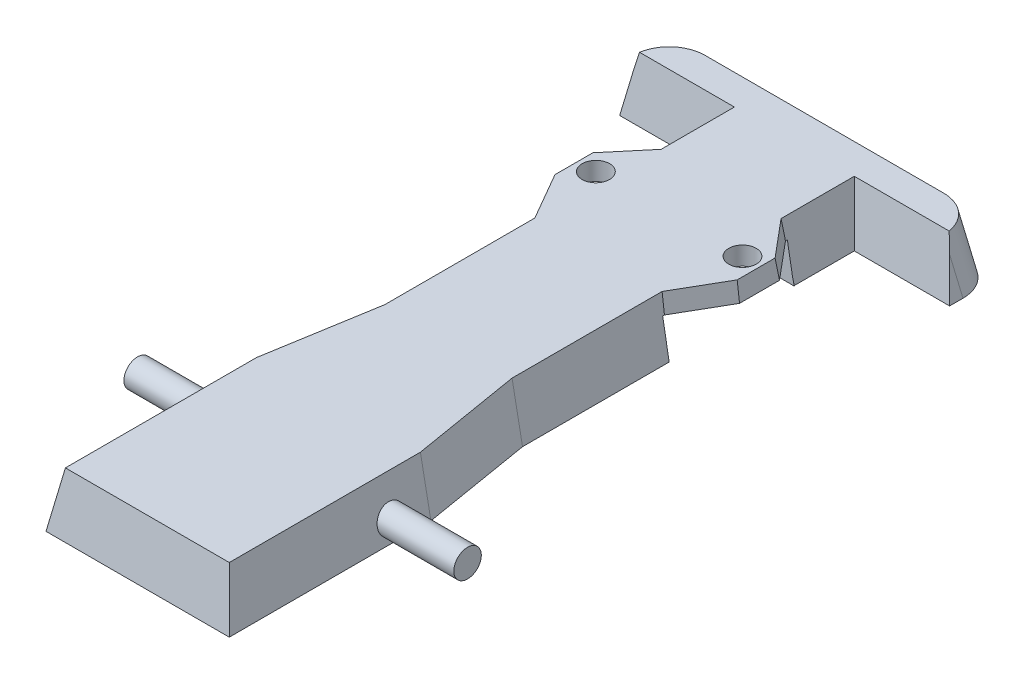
ISO-10303-21;
HEADER;
FILE_DESCRIPTION(('STEP AP214'),'2;1');
FILE_NAME('part.step','',(''),(''),'','','');
FILE_SCHEMA(('AUTOMOTIVE_DESIGN { 1 0 10303 214 1 1 1 1 }'));
ENDSEC;
DATA;
#1=APPLICATION_CONTEXT('core data for automotive mechanical design processes');
#2=APPLICATION_PROTOCOL_DEFINITION('international standard','automotive_design',2000,#1);
#3=PRODUCT_CONTEXT('',#1,'mechanical');
#4=PRODUCT('Part','Part','',(#3));
#5=PRODUCT_RELATED_PRODUCT_CATEGORY('part','',(#4));
#6=PRODUCT_DEFINITION_FORMATION('','',#4);
#7=PRODUCT_DEFINITION_CONTEXT('part definition',#1,'design');
#8=PRODUCT_DEFINITION('design','',#6,#7);
#9=PRODUCT_DEFINITION_SHAPE('','',#8);
#10=(LENGTH_UNIT() NAMED_UNIT(*) SI_UNIT(.MILLI.,.METRE.));
#11=(NAMED_UNIT(*) PLANE_ANGLE_UNIT() SI_UNIT($,.RADIAN.));
#12=(NAMED_UNIT(*) SI_UNIT($,.STERADIAN.) SOLID_ANGLE_UNIT());
#13=UNCERTAINTY_MEASURE_WITH_UNIT(LENGTH_MEASURE(1.E-05),#10,'distance_accuracy_value','');
#14=(GEOMETRIC_REPRESENTATION_CONTEXT(3) GLOBAL_UNCERTAINTY_ASSIGNED_CONTEXT((#13)) GLOBAL_UNIT_ASSIGNED_CONTEXT((#10,
#11,#12)) REPRESENTATION_CONTEXT('',''));
#15=CARTESIAN_POINT('',(0.,0.,0.));
#16=DIRECTION('',(0.,0.,1.));
#17=DIRECTION('',(1.,0.,0.));
#18=AXIS2_PLACEMENT_3D('',#15,#16,#17);
#19=CARTESIAN_POINT('',(282.092260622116,0.,-236.70351184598));
#20=DIRECTION('',(0.754406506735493,0.173648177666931,-0.633022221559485));
#21=DIRECTION('',(-0.642787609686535,0.,-0.766044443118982));
#22=AXIS2_PLACEMENT_3D('',#19,#20,#21);
#23=PLANE('',#22);
#24=DIRECTION('',(-0.642787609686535,0.,-0.766044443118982));
#25=VECTOR('',#24,1.);
#26=CARTESIAN_POINT('',(275.230485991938,50.8,-230.945799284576));
#27=LINE('',#26,#25);
#28=CARTESIAN_POINT('',(87.56258938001,50.8,-454.599689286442));
#29=VERTEX_POINT('',#28);
#30=CARTESIAN_POINT('',(130.74258938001,50.8,-403.139769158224));
#31=VERTEX_POINT('',#30);
#32=EDGE_CURVE('E325',#29,#31,#27,.F.);
#33=ORIENTED_EDGE('',*,*,#32,.F.);
#34=DIRECTION('',(0.173302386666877,-0.982846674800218,-0.0630769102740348));
#35=VECTOR('',#34,1.);
#36=CARTESIAN_POINT('',(99.6758802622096,-17.897886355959,-459.008566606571));
#37=LINE('',#36,#35);
#38=CARTESIAN_POINT('',(83.083884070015,76.2,-452.969573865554));
#39=VERTEX_POINT('',#38);
#40=EDGE_CURVE('E279',#39,#29,#37,.T.);
#41=ORIENTED_EDGE('',*,*,#40,.F.);
#42=DIRECTION('',(0.642787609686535,0.,0.766044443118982));
#43=VECTOR('',#42,1.);
#44=CARTESIAN_POINT('',(271.799598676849,76.2,-228.066943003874));
#45=LINE('',#44,#43);
#46=CARTESIAN_POINT('',(126.263884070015,76.2,-401.509653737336));
#47=VERTEX_POINT('',#46);
#48=EDGE_CURVE('E383',#47,#39,#45,.F.);
#49=ORIENTED_EDGE('',*,*,#48,.F.);
#50=DIRECTION('',(0.173302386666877,-0.982846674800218,-0.0630769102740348));
#51=VECTOR('',#50,1.);
#52=CARTESIAN_POINT('',(142.12155224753,-13.7333052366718,-407.281372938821));
#53=LINE('',#52,#51);
#54=EDGE_CURVE('E283',#47,#31,#53,.T.);
#55=ORIENTED_EDGE('',*,*,#54,.T.);
#56=EDGE_LOOP('',(#33,#41,#49,#55));
#57=FACE_BOUND('',#56,.T.);
#58=ADVANCED_FACE('F38',(#57),#23,.T.);
#59=CARTESIAN_POINT('',(-282.092260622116,0.,-236.70351184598));
#60=DIRECTION('',(-0.754406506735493,0.173648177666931,-0.633022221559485));
#61=DIRECTION('',(-0.642787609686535,0.,0.766044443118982));
#62=AXIS2_PLACEMENT_3D('',#59,#60,#61);
#63=PLANE('',#62);
#64=DIRECTION('',(-0.224312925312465,-0.974517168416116,0.));
#65=VECTOR('',#64,1.);
#66=CARTESIAN_POINT('',(-106.383184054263,-40.4444562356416,-457.2));
#67=LINE('',#66,#65);
#68=CARTESIAN_POINT('',(-97.0737387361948,0.,-457.2));
#69=VERTEX_POINT('',#68);
#70=CARTESIAN_POINT('',(-94.7068843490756,10.2826898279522,-457.2));
#71=VERTEX_POINT('',#70);
#72=EDGE_CURVE('E254',#69,#71,#67,.F.);
#73=ORIENTED_EDGE('',*,*,#72,.T.);
#74=DIRECTION('',(-0.173302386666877,-0.982846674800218,-0.0630769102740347));
#75=VECTOR('',#74,1.);
#76=CARTESIAN_POINT('',(-91.5149596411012,28.3849943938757,-456.038234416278));
#77=LINE('',#76,#75);
#78=CARTESIAN_POINT('',(-96.52,0.,-457.859920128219));
#79=VERTEX_POINT('',#78);
#80=EDGE_CURVE('E264',#71,#79,#77,.T.);
#81=ORIENTED_EDGE('',*,*,#80,.T.);
#82=DIRECTION('',(0.642787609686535,0.,-0.766044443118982));
#83=VECTOR('',#82,1.);
#84=CARTESIAN_POINT('',(-282.092260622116,0.,-236.70351184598));
#85=LINE('',#84,#83);
#86=EDGE_CURVE('E329',#79,#69,#85,.F.);
#87=ORIENTED_EDGE('',*,*,#86,.T.);
#88=EDGE_LOOP('',(#73,#81,#87));
#89=FACE_BOUND('',#88,.T.);
#90=ADVANCED_FACE('F547',(#89),#63,.T.);
#91=CARTESIAN_POINT('',(0.,0.,0.));
#92=DIRECTION('',(0.,1.,0.));
#93=DIRECTION('',(0.,0.,1.));
#94=AXIS2_PLACEMENT_3D('',#91,#92,#93);
#95=PLANE('',#94);
#96=DIRECTION('',(0.,0.,-1.));
#97=VECTOR('',#96,1.);
#98=CARTESIAN_POINT('',(-101.6,0.,0.));
#99=LINE('',#98,#97);
#100=CARTESIAN_POINT('',(-101.6,0.,-279.4));
#101=VERTEX_POINT('',#100);
#102=CARTESIAN_POINT('',(-101.6,0.,-76.2));
#103=VERTEX_POINT('',#102);
#104=EDGE_CURVE('E312',#101,#103,#99,.F.);
#105=ORIENTED_EDGE('',*,*,#104,.F.);
#106=DIRECTION('',(-1.,0.,0.));
#107=VECTOR('',#106,1.);
#108=CARTESIAN_POINT('',(-139.7,0.,-279.4));
#109=LINE('',#108,#107);
#110=CARTESIAN_POINT('',(101.6,0.,-279.4));
#111=VERTEX_POINT('',#110);
#112=EDGE_CURVE('E321',#111,#101,#109,.T.);
#113=ORIENTED_EDGE('',*,*,#112,.F.);
#114=DIRECTION('',(0.,0.,1.));
#115=VECTOR('',#114,1.);
#116=CARTESIAN_POINT('',(101.6,0.,0.));
#117=LINE('',#116,#115);
#118=CARTESIAN_POINT('',(101.6,0.,-76.2000000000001));
#119=VERTEX_POINT('',#118);
#120=EDGE_CURVE('E353',#119,#111,#117,.F.);
#121=ORIENTED_EDGE('',*,*,#120,.F.);
#122=DIRECTION('',(0.164398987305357,0.,0.986393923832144));
#123=VECTOR('',#122,1.);
#124=CARTESIAN_POINT('',(111.210810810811,0.,-18.5351351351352));
#125=LINE('',#124,#123);
#126=CARTESIAN_POINT('',(127.,0.,76.2));
#127=VERTEX_POINT('',#126);
#128=EDGE_CURVE('E363',#127,#119,#125,.F.);
#129=ORIENTED_EDGE('',*,*,#128,.F.);
#130=DIRECTION('',(0.,0.,1.));
#131=VECTOR('',#130,1.);
#132=CARTESIAN_POINT('',(127.,0.,0.));
#133=LINE('',#132,#131);
#134=CARTESIAN_POINT('',(127.,0.,355.6));
#135=VERTEX_POINT('',#134);
#136=EDGE_CURVE('E365',#135,#127,#133,.F.);
#137=ORIENTED_EDGE('',*,*,#136,.F.);
#138=DIRECTION('',(-1.,0.,0.));
#139=VECTOR('',#138,1.);
#140=CARTESIAN_POINT('',(0.,0.,355.6));
#141=LINE('',#140,#139);
#142=CARTESIAN_POINT('',(-127.,0.,355.6));
#143=VERTEX_POINT('',#142);
#144=EDGE_CURVE('E309',#143,#135,#141,.F.);
#145=ORIENTED_EDGE('',*,*,#144,.F.);
#146=DIRECTION('',(0.,0.,-1.));
#147=VECTOR('',#146,1.);
#148=CARTESIAN_POINT('',(-127.,0.,0.));
#149=LINE('',#148,#147);
#150=CARTESIAN_POINT('',(-127.,0.,76.2));
#151=VERTEX_POINT('',#150);
#152=EDGE_CURVE('E307',#151,#143,#149,.F.);
#153=ORIENTED_EDGE('',*,*,#152,.F.);
#154=DIRECTION('',(0.164398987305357,0.,-0.986393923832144));
#155=VECTOR('',#154,1.);
#156=CARTESIAN_POINT('',(-111.210810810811,0.,-18.5351351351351));
#157=LINE('',#156,#155);
#158=EDGE_CURVE('E310',#103,#151,#157,.F.);
#159=ORIENTED_EDGE('',*,*,#158,.F.);
#160=EDGE_LOOP('',(#105,#113,#121,#129,#137,#145,#153,#159));
#161=FACE_BOUND('',#160,.T.);
#162=ADVANCED_FACE('F511',(#161),#95,.F.);
#163=CARTESIAN_POINT('',(-139.7,0.,0.));
#164=DIRECTION('',(-0.984807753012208,0.173648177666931,0.));
#165=DIRECTION('',(-0.173648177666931,-0.984807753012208,0.));
#166=AXIS2_PLACEMENT_3D('',#163,#164,#165);
#167=PLANE('',#166);
#168=DIRECTION('',(0.,0.,1.));
#169=VECTOR('',#168,1.);
#170=CARTESIAN_POINT('',(-130.74258938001,50.8,0.));
#171=LINE('',#170,#169);
#172=CARTESIAN_POINT('',(-130.74258938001,50.8,-347.791266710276));
#173=VERTEX_POINT('',#172);
#174=CARTESIAN_POINT('',(-130.74258938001,50.8,-403.139769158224));
#175=VERTEX_POINT('',#174);
#176=EDGE_CURVE('E318',#173,#175,#171,.F.);
#177=ORIENTED_EDGE('',*,*,#176,.F.);
#178=DIRECTION('',(-0.173460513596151,-0.983743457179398,0.0464786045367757));
#179=VECTOR('',#178,1.);
#180=CARTESIAN_POINT('',(-136.725309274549,16.870309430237,-346.188201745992));
#181=LINE('',#180,#179);
#182=CARTESIAN_POINT('',(-126.263884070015,76.2,-348.991332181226));
#183=VERTEX_POINT('',#182);
#184=EDGE_CURVE('E245',#183,#173,#181,.T.);
#185=ORIENTED_EDGE('',*,*,#184,.F.);
#186=DIRECTION('',(0.,0.,-1.));
#187=VECTOR('',#186,1.);
#188=CARTESIAN_POINT('',(-126.263884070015,76.2,0.));
#189=LINE('',#188,#187);
#190=CARTESIAN_POINT('',(-126.263884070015,76.2,-401.509653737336));
#191=VERTEX_POINT('',#190);
#192=EDGE_CURVE('E332',#191,#183,#189,.F.);
#193=ORIENTED_EDGE('',*,*,#192,.F.);
#194=DIRECTION('',(-0.173302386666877,-0.982846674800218,-0.0630769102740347));
#195=VECTOR('',#194,1.);
#196=CARTESIAN_POINT('',(-135.257487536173,25.1947401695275,-404.78305769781));
#197=LINE('',#196,#195);
#198=EDGE_CURVE('E261',#191,#175,#197,.T.);
#199=ORIENTED_EDGE('',*,*,#198,.T.);
#200=EDGE_LOOP('',(#177,#185,#193,#199));
#201=FACE_BOUND('',#200,.T.);
#202=ADVANCED_FACE('F583',(#201),#167,.T.);
#203=CARTESIAN_POINT('',(44.7837489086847,0.,-25.8559094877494));
#204=DIRECTION('',(-0.852868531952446,0.173648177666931,0.492403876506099));
#205=DIRECTION('',(0.499999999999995,0.,0.866025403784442));
#206=AXIS2_PLACEMENT_3D('',#203,#204,#205);
#207=PLANE('',#206);
#208=DIRECTION('',(0.499999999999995,0.,0.866025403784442));
#209=VECTOR('',#208,1.);
#210=CARTESIAN_POINT('',(52.5410940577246,50.8,-30.3346147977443));
#211=LINE('',#210,#209);
#212=CARTESIAN_POINT('',(-92.6425893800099,50.8,-281.8001309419));
#213=VERTEX_POINT('',#212);
#214=EDGE_CURVE('E226',#213,#173,#211,.F.);
#215=ORIENTED_EDGE('',*,*,#214,.F.);
#216=DIRECTION('',(-0.173460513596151,-0.983743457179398,0.0464786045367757));
#217=VECTOR('',#216,1.);
#218=CARTESIAN_POINT('',(-99.2396491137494,13.3862150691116,-280.032454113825));
#219=LINE('',#218,#217);
#220=CARTESIAN_POINT('',(-88.1638840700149,76.2,-283.000196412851));
#221=VERTEX_POINT('',#220);
#222=EDGE_CURVE('E242',#221,#213,#219,.T.);
#223=ORIENTED_EDGE('',*,*,#222,.F.);
#224=DIRECTION('',(-0.499999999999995,0.,-0.866025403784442));
#225=VECTOR('',#224,1.);
#226=CARTESIAN_POINT('',(56.4197666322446,76.2,-32.5739674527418));
#227=LINE('',#226,#225);
#228=EDGE_CURVE('E400',#183,#221,#227,.F.);
#229=ORIENTED_EDGE('',*,*,#228,.F.);
#230=ORIENTED_EDGE('',*,*,#184,.T.);
#231=EDGE_LOOP('',(#215,#223,#229,#230));
#232=FACE_BOUND('',#231,.T.);
#233=ADVANCED_FACE('F241',(#232),#207,.T.);
#234=CARTESIAN_POINT('',(-44.783748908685,0.,-25.8559094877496));
#235=DIRECTION('',(0.852868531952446,0.173648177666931,0.4924038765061));
#236=DIRECTION('',(0.499999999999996,0.,-0.866025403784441));
#237=AXIS2_PLACEMENT_3D('',#234,#235,#236);
#238=PLANE('',#237);
#239=DIRECTION('',(0.499999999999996,0.,-0.866025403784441));
#240=VECTOR('',#239,1.);
#241=CARTESIAN_POINT('',(-52.541094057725,50.8,-30.3346147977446));
#242=LINE('',#241,#240);
#243=CARTESIAN_POINT('',(130.74258938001,50.8,-347.791266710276));
#244=VERTEX_POINT('',#243);
#245=CARTESIAN_POINT('',(92.6425893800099,50.8,-281.8001309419));
#246=VERTEX_POINT('',#245);
#247=EDGE_CURVE('E247',#244,#246,#242,.F.);
#248=ORIENTED_EDGE('',*,*,#247,.F.);
#249=DIRECTION('',(0.173460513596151,-0.983743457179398,0.0464786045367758));
#250=VECTOR('',#249,1.);
#251=CARTESIAN_POINT('',(142.484613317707,-15.7923268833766,-344.645000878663));
#252=LINE('',#251,#250);
#253=CARTESIAN_POINT('',(126.263884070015,76.2,-348.991332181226));
#254=VERTEX_POINT('',#253);
#255=EDGE_CURVE('E286',#254,#244,#252,.T.);
#256=ORIENTED_EDGE('',*,*,#255,.F.);
#257=DIRECTION('',(-0.499999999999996,0.,0.866025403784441));
#258=VECTOR('',#257,1.);
#259=CARTESIAN_POINT('',(-56.4197666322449,76.2,-32.5739674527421));
#260=LINE('',#259,#258);
#261=CARTESIAN_POINT('',(88.1638840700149,76.2,-283.000196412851));
#262=VERTEX_POINT('',#261);
#263=EDGE_CURVE('E379',#262,#254,#260,.F.);
#264=ORIENTED_EDGE('',*,*,#263,.F.);
#265=DIRECTION('',(0.173460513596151,-0.983743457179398,0.0464786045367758));
#266=VECTOR('',#265,1.);
#267=CARTESIAN_POINT('',(103.852579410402,-12.7750126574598,-278.796423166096));
#268=LINE('',#267,#266);
#269=EDGE_CURVE('E290',#262,#246,#268,.T.);
#270=ORIENTED_EDGE('',*,*,#269,.T.);
#271=EDGE_LOOP('',(#248,#256,#264,#270));
#272=FACE_BOUND('',#271,.T.);
#273=ADVANCED_FACE('F589',(#272),#238,.T.);
#274=CARTESIAN_POINT('',(139.7,0.,-1.27111165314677E-13));
#275=DIRECTION('',(0.984807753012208,0.173648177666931,0.));
#276=DIRECTION('',(-0.173648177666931,0.984807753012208,0.));
#277=AXIS2_PLACEMENT_3D('',#274,#275,#276);
#278=PLANE('',#277);
#279=DIRECTION('',(0.,0.,-1.));
#280=VECTOR('',#279,1.);
#281=CARTESIAN_POINT('',(130.74258938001,50.8,-1.18960936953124E-13));
#282=LINE('',#281,#280);
#283=EDGE_CURVE('E356',#31,#244,#282,.F.);
#284=ORIENTED_EDGE('',*,*,#283,.F.);
#285=ORIENTED_EDGE('',*,*,#54,.F.);
#286=DIRECTION('',(0.,0.,1.));
#287=VECTOR('',#286,1.);
#288=CARTESIAN_POINT('',(126.263884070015,76.2,-1.14885822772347E-13));
#289=LINE('',#288,#287);
#290=EDGE_CURVE('E381',#254,#47,#289,.F.);
#291=ORIENTED_EDGE('',*,*,#290,.F.);
#292=ORIENTED_EDGE('',*,*,#255,.T.);
#293=EDGE_LOOP('',(#284,#285,#291,#292));
#294=FACE_BOUND('',#293,.T.);
#295=ADVANCED_FACE('F606',(#294),#278,.T.);
#296=CARTESIAN_POINT('',(-101.6,76.2,-381.));
#297=DIRECTION('',(0.,-1.,0.));
#298=DIRECTION('',(0.,0.,-1.));
#299=AXIS2_PLACEMENT_3D('',#296,#297,#298);
#300=CYLINDRICAL_SURFACE('',#299,19.05);
#301=CARTESIAN_POINT('',(-101.6,76.2,-381.));
#302=DIRECTION('',(0.,1.,0.));
#303=DIRECTION('',(0.,0.,1.));
#304=AXIS2_PLACEMENT_3D('',#301,#302,#303);
#305=CIRCLE('',#304,19.05);
#306=CARTESIAN_POINT('',(-101.6,76.2,-400.05));
#307=VERTEX_POINT('',#306);
#308=EDGE_CURVE('E314',#307,#307,#305,.T.);
#309=CARTESIAN_POINT('',(-101.6,50.8,-381.));
#310=DIRECTION('',(0.,-1.,0.));
#311=DIRECTION('',(0.,0.,-1.));
#312=AXIS2_PLACEMENT_3D('',#309,#310,#311);
#313=CIRCLE('',#312,19.05);
#314=CARTESIAN_POINT('',(-101.6,50.8,-400.05));
#315=VERTEX_POINT('',#314);
#316=EDGE_CURVE('E326',#315,#315,#313,.T.);
#317=CARTESIAN_POINT('',(-101.6,76.2,-400.05));
#318=CARTESIAN_POINT('',(-101.6,75.9354166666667,-400.05));
#319=CARTESIAN_POINT('',(-101.6,75.6708333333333,-400.05));
#320=CARTESIAN_POINT('',(-101.6,75.1416666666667,-400.05));
#321=CARTESIAN_POINT('',(-101.6,74.8770833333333,-400.05));
#322=CARTESIAN_POINT('',(-101.6,74.3479166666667,-400.05));
#323=CARTESIAN_POINT('',(-101.6,74.0833333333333,-400.05));
#324=CARTESIAN_POINT('',(-101.6,73.5541666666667,-400.05));
#325=CARTESIAN_POINT('',(-101.6,73.2895833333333,-400.05));
#326=CARTESIAN_POINT('',(-101.6,72.7604166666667,-400.05));
#327=CARTESIAN_POINT('',(-101.6,72.4958333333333,-400.05));
#328=CARTESIAN_POINT('',(-101.6,71.9666666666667,-400.05));
#329=CARTESIAN_POINT('',(-101.6,71.7020833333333,-400.05));
#330=CARTESIAN_POINT('',(-101.6,71.1729166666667,-400.05));
#331=CARTESIAN_POINT('',(-101.6,70.9083333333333,-400.05));
#332=CARTESIAN_POINT('',(-101.6,70.3791666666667,-400.05));
#333=CARTESIAN_POINT('',(-101.6,70.1145833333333,-400.05));
#334=CARTESIAN_POINT('',(-101.6,69.5854166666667,-400.05));
#335=CARTESIAN_POINT('',(-101.6,69.3208333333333,-400.05));
#336=CARTESIAN_POINT('',(-101.6,68.7916666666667,-400.05));
#337=CARTESIAN_POINT('',(-101.6,68.5270833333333,-400.05));
#338=CARTESIAN_POINT('',(-101.6,67.9979166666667,-400.05));
#339=CARTESIAN_POINT('',(-101.6,67.7333333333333,-400.05));
#340=CARTESIAN_POINT('',(-101.6,67.2041666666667,-400.05));
#341=CARTESIAN_POINT('',(-101.6,66.9395833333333,-400.05));
#342=CARTESIAN_POINT('',(-101.6,66.4104166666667,-400.05));
#343=CARTESIAN_POINT('',(-101.6,66.1458333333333,-400.05));
#344=CARTESIAN_POINT('',(-101.6,65.6166666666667,-400.05));
#345=CARTESIAN_POINT('',(-101.6,65.3520833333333,-400.05));
#346=CARTESIAN_POINT('',(-101.6,64.8229166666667,-400.05));
#347=CARTESIAN_POINT('',(-101.6,64.5583333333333,-400.05));
#348=CARTESIAN_POINT('',(-101.6,64.0291666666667,-400.05));
#349=CARTESIAN_POINT('',(-101.6,63.7645833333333,-400.05));
#350=CARTESIAN_POINT('',(-101.6,63.2354166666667,-400.05));
#351=CARTESIAN_POINT('',(-101.6,62.9708333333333,-400.05));
#352=CARTESIAN_POINT('',(-101.6,62.4416666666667,-400.05));
#353=CARTESIAN_POINT('',(-101.6,62.1770833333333,-400.05));
#354=CARTESIAN_POINT('',(-101.6,61.6479166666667,-400.05));
#355=CARTESIAN_POINT('',(-101.6,61.3833333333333,-400.05));
#356=CARTESIAN_POINT('',(-101.6,60.8541666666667,-400.05));
#357=CARTESIAN_POINT('',(-101.6,60.5895833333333,-400.05));
#358=CARTESIAN_POINT('',(-101.6,60.0604166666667,-400.05));
#359=CARTESIAN_POINT('',(-101.6,59.7958333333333,-400.05));
#360=CARTESIAN_POINT('',(-101.6,59.2666666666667,-400.05));
#361=CARTESIAN_POINT('',(-101.6,59.0020833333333,-400.05));
#362=CARTESIAN_POINT('',(-101.6,58.4729166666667,-400.05));
#363=CARTESIAN_POINT('',(-101.6,58.2083333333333,-400.05));
#364=CARTESIAN_POINT('',(-101.6,57.6791666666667,-400.05));
#365=CARTESIAN_POINT('',(-101.6,57.4145833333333,-400.05));
#366=CARTESIAN_POINT('',(-101.6,56.8854166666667,-400.05));
#367=CARTESIAN_POINT('',(-101.6,56.6208333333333,-400.05));
#368=CARTESIAN_POINT('',(-101.6,56.0916666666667,-400.05));
#369=CARTESIAN_POINT('',(-101.6,55.8270833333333,-400.05));
#370=CARTESIAN_POINT('',(-101.6,55.2979166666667,-400.05));
#371=CARTESIAN_POINT('',(-101.6,55.0333333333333,-400.05));
#372=CARTESIAN_POINT('',(-101.6,54.5041666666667,-400.05));
#373=CARTESIAN_POINT('',(-101.6,54.2395833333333,-400.05));
#374=CARTESIAN_POINT('',(-101.6,53.7104166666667,-400.05));
#375=CARTESIAN_POINT('',(-101.6,53.4458333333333,-400.05));
#376=CARTESIAN_POINT('',(-101.6,52.9166666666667,-400.05));
#377=CARTESIAN_POINT('',(-101.6,52.6520833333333,-400.05));
#378=CARTESIAN_POINT('',(-101.6,52.1229166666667,-400.05));
#379=CARTESIAN_POINT('',(-101.6,51.8583333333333,-400.05));
#380=CARTESIAN_POINT('',(-101.6,51.3291666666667,-400.05));
#381=CARTESIAN_POINT('',(-101.6,51.0645833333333,-400.05));
#382=CARTESIAN_POINT('',(-101.6,50.8,-400.05));
#383=B_SPLINE_CURVE_WITH_KNOTS('',3,(#317,#318,#319,#320,#321,#322,#323,#324,#325,#326,#327,
#328,#329,#330,#331,#332,#333,#334,#335,#336,#337,#338,#339,#340,#341,#342,#343,#344,#345,#346,
#347,#348,#349,#350,#351,#352,#353,#354,#355,#356,#357,#358,#359,#360,#361,#362,#363,#364,#365,
#366,#367,#368,#369,#370,#371,#372,#373,#374,#375,#376,#377,#378,#379,#380,#381,#382),
.UNSPECIFIED.,.F.,.F.,(4,2,2,2,2,2,2,2,2,2,2,2,2,2,2,2,2,2,2,2,2,2,2,2,2,2,2,2,2,2,2,2,4),(0.,
0.793749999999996,1.58749999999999,2.38124999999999,3.175,3.96874999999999,4.76249999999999,
5.55624999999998,6.34999999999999,7.14374999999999,7.93749999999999,8.73125,9.52499999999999,
10.31875,11.1125,11.90625,12.7,13.49375,14.2875,15.08125,15.875,16.66875,17.4625,18.25625,19.05,
19.84375,20.6375,21.43125,22.225,23.01875,23.8125,24.60625,25.4),.UNSPECIFIED.);
#384=EDGE_CURVE('BSEAM603',#307,#315,#383,.T.);
#385=ORIENTED_EDGE('',*,*,#308,.T.);
#386=ORIENTED_EDGE('',*,*,#316,.T.);
#387=ORIENTED_EDGE('',*,*,#384,.T.);
#388=ORIENTED_EDGE('',*,*,#384,.F.);
#389=EDGE_LOOP('',(#385,#387,#386,#388));
#390=FACE_BOUND('',#389,.T.);
#391=ADVANCED_FACE('F603',(#390),#300,.F.);
#392=CARTESIAN_POINT('',(101.6,76.2,-381.));
#393=DIRECTION('',(0.,-1.,0.));
#394=DIRECTION('',(0.,0.,-1.));
#395=AXIS2_PLACEMENT_3D('',#392,#393,#394);
#396=CYLINDRICAL_SURFACE('',#395,19.05);
#397=CARTESIAN_POINT('',(101.6,76.2,-381.));
#398=DIRECTION('',(0.,1.,0.));
#399=DIRECTION('',(0.,0.,1.));
#400=AXIS2_PLACEMENT_3D('',#397,#398,#399);
#401=CIRCLE('',#400,19.05);
#402=CARTESIAN_POINT('',(101.6,76.2,-400.05));
#403=VERTEX_POINT('',#402);
#404=EDGE_CURVE('E316',#403,#403,#401,.T.);
#405=CARTESIAN_POINT('',(101.6,50.8,-381.));
#406=DIRECTION('',(0.,-1.,0.));
#407=DIRECTION('',(0.,0.,-1.));
#408=AXIS2_PLACEMENT_3D('',#405,#406,#407);
#409=CIRCLE('',#408,19.05);
#410=CARTESIAN_POINT('',(101.6,50.8,-400.05));
#411=VERTEX_POINT('',#410);
#412=EDGE_CURVE('E490',#411,#411,#409,.T.);
#413=CARTESIAN_POINT('',(101.6,76.2,-400.05));
#414=CARTESIAN_POINT('',(101.6,75.9354166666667,-400.05));
#415=CARTESIAN_POINT('',(101.6,75.6708333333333,-400.05));
#416=CARTESIAN_POINT('',(101.6,75.1416666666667,-400.05));
#417=CARTESIAN_POINT('',(101.6,74.8770833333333,-400.05));
#418=CARTESIAN_POINT('',(101.6,74.3479166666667,-400.05));
#419=CARTESIAN_POINT('',(101.6,74.0833333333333,-400.05));
#420=CARTESIAN_POINT('',(101.6,73.5541666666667,-400.05));
#421=CARTESIAN_POINT('',(101.6,73.2895833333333,-400.05));
#422=CARTESIAN_POINT('',(101.6,72.7604166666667,-400.05));
#423=CARTESIAN_POINT('',(101.6,72.4958333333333,-400.05));
#424=CARTESIAN_POINT('',(101.6,71.9666666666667,-400.05));
#425=CARTESIAN_POINT('',(101.6,71.7020833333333,-400.05));
#426=CARTESIAN_POINT('',(101.6,71.1729166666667,-400.05));
#427=CARTESIAN_POINT('',(101.6,70.9083333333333,-400.05));
#428=CARTESIAN_POINT('',(101.6,70.3791666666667,-400.05));
#429=CARTESIAN_POINT('',(101.6,70.1145833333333,-400.05));
#430=CARTESIAN_POINT('',(101.6,69.5854166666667,-400.05));
#431=CARTESIAN_POINT('',(101.6,69.3208333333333,-400.05));
#432=CARTESIAN_POINT('',(101.6,68.7916666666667,-400.05));
#433=CARTESIAN_POINT('',(101.6,68.5270833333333,-400.05));
#434=CARTESIAN_POINT('',(101.6,67.9979166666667,-400.05));
#435=CARTESIAN_POINT('',(101.6,67.7333333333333,-400.05));
#436=CARTESIAN_POINT('',(101.6,67.2041666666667,-400.05));
#437=CARTESIAN_POINT('',(101.6,66.9395833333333,-400.05));
#438=CARTESIAN_POINT('',(101.6,66.4104166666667,-400.05));
#439=CARTESIAN_POINT('',(101.6,66.1458333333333,-400.05));
#440=CARTESIAN_POINT('',(101.6,65.6166666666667,-400.05));
#441=CARTESIAN_POINT('',(101.6,65.3520833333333,-400.05));
#442=CARTESIAN_POINT('',(101.6,64.8229166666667,-400.05));
#443=CARTESIAN_POINT('',(101.6,64.5583333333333,-400.05));
#444=CARTESIAN_POINT('',(101.6,64.0291666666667,-400.05));
#445=CARTESIAN_POINT('',(101.6,63.7645833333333,-400.05));
#446=CARTESIAN_POINT('',(101.6,63.2354166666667,-400.05));
#447=CARTESIAN_POINT('',(101.6,62.9708333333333,-400.05));
#448=CARTESIAN_POINT('',(101.6,62.4416666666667,-400.05));
#449=CARTESIAN_POINT('',(101.6,62.1770833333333,-400.05));
#450=CARTESIAN_POINT('',(101.6,61.6479166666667,-400.05));
#451=CARTESIAN_POINT('',(101.6,61.3833333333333,-400.05));
#452=CARTESIAN_POINT('',(101.6,60.8541666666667,-400.05));
#453=CARTESIAN_POINT('',(101.6,60.5895833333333,-400.05));
#454=CARTESIAN_POINT('',(101.6,60.0604166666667,-400.05));
#455=CARTESIAN_POINT('',(101.6,59.7958333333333,-400.05));
#456=CARTESIAN_POINT('',(101.6,59.2666666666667,-400.05));
#457=CARTESIAN_POINT('',(101.6,59.0020833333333,-400.05));
#458=CARTESIAN_POINT('',(101.6,58.4729166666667,-400.05));
#459=CARTESIAN_POINT('',(101.6,58.2083333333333,-400.05));
#460=CARTESIAN_POINT('',(101.6,57.6791666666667,-400.05));
#461=CARTESIAN_POINT('',(101.6,57.4145833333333,-400.05));
#462=CARTESIAN_POINT('',(101.6,56.8854166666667,-400.05));
#463=CARTESIAN_POINT('',(101.6,56.6208333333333,-400.05));
#464=CARTESIAN_POINT('',(101.6,56.0916666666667,-400.05));
#465=CARTESIAN_POINT('',(101.6,55.8270833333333,-400.05));
#466=CARTESIAN_POINT('',(101.6,55.2979166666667,-400.05));
#467=CARTESIAN_POINT('',(101.6,55.0333333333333,-400.05));
#468=CARTESIAN_POINT('',(101.6,54.5041666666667,-400.05));
#469=CARTESIAN_POINT('',(101.6,54.2395833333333,-400.05));
#470=CARTESIAN_POINT('',(101.6,53.7104166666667,-400.05));
#471=CARTESIAN_POINT('',(101.6,53.4458333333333,-400.05));
#472=CARTESIAN_POINT('',(101.6,52.9166666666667,-400.05));
#473=CARTESIAN_POINT('',(101.6,52.6520833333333,-400.05));
#474=CARTESIAN_POINT('',(101.6,52.1229166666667,-400.05));
#475=CARTESIAN_POINT('',(101.6,51.8583333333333,-400.05));
#476=CARTESIAN_POINT('',(101.6,51.3291666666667,-400.05));
#477=CARTESIAN_POINT('',(101.6,51.0645833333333,-400.05));
#478=CARTESIAN_POINT('',(101.6,50.8,-400.05));
#479=B_SPLINE_CURVE_WITH_KNOTS('',3,(#413,#414,#415,#416,#417,#418,#419,#420,#421,#422,#423,
#424,#425,#426,#427,#428,#429,#430,#431,#432,#433,#434,#435,#436,#437,#438,#439,#440,#441,#442,
#443,#444,#445,#446,#447,#448,#449,#450,#451,#452,#453,#454,#455,#456,#457,#458,#459,#460,#461,
#462,#463,#464,#465,#466,#467,#468,#469,#470,#471,#472,#473,#474,#475,#476,#477,#478),
.UNSPECIFIED.,.F.,.F.,(4,2,2,2,2,2,2,2,2,2,2,2,2,2,2,2,2,2,2,2,2,2,2,2,2,2,2,2,2,2,2,2,4),(0.,
0.793749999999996,1.58749999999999,2.38124999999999,3.175,3.96874999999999,4.76249999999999,
5.55624999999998,6.34999999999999,7.14374999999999,7.93749999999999,8.73125,9.52499999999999,
10.31875,11.1125,11.90625,12.7,13.49375,14.2875,15.08125,15.875,16.66875,17.4625,18.25625,19.05,
19.84375,20.6375,21.43125,22.225,23.01875,23.8125,24.60625,25.4),.UNSPECIFIED.);
#480=EDGE_CURVE('BSEAM601',#403,#411,#479,.T.);
#481=ORIENTED_EDGE('',*,*,#404,.T.);
#482=ORIENTED_EDGE('',*,*,#412,.T.);
#483=ORIENTED_EDGE('',*,*,#480,.T.);
#484=ORIENTED_EDGE('',*,*,#480,.F.);
#485=EDGE_LOOP('',(#481,#483,#482,#484));
#486=FACE_BOUND('',#485,.T.);
#487=ADVANCED_FACE('F601',(#486),#396,.F.);
#488=CARTESIAN_POINT('',(0.,76.2,0.));
#489=DIRECTION('',(0.,1.,0.));
#490=DIRECTION('',(0.,0.,1.));
#491=AXIS2_PLACEMENT_3D('',#488,#489,#490);
#492=PLANE('',#491);
#493=ORIENTED_EDGE('',*,*,#308,.F.);
#494=EDGE_LOOP('',(#493));
#495=FACE_BOUND('',#494,.T.);
#496=DIRECTION('',(1.,0.,0.));
#497=VECTOR('',#496,1.);
#498=CARTESIAN_POINT('',(0.,76.2,-596.163884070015));
#499=LINE('',#498,#497);
#500=CARTESIAN_POINT('',(165.135650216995,76.2,-596.163884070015));
#501=VERTEX_POINT('',#500);
#502=CARTESIAN_POINT('',(-165.135650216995,76.2,-596.163884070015));
#503=VERTEX_POINT('',#502);
#504=EDGE_CURVE('E391',#501,#503,#499,.F.);
#505=ORIENTED_EDGE('',*,*,#504,.T.);
#506=CARTESIAN_POINT('',(-163.580212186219,76.2,-544.580212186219));
#507=DIRECTION('',(0.,1.,0.));
#508=DIRECTION('',(-0.707106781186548,0.,-0.707106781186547));
#509=AXIS2_PLACEMENT_3D('',#506,#507,#508);
#510=ELLIPSE('',#509,52.3556148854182,50.8);
#511=CARTESIAN_POINT('',(-214.484439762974,76.2,-554.456115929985));
#512=VERTEX_POINT('',#511);
#513=EDGE_CURVE('E60',#503,#512,#510,.T.);
#514=ORIENTED_EDGE('',*,*,#513,.T.);
#515=DIRECTION('',(-1.,0.,0.));
#516=VECTOR('',#515,1.);
#517=CARTESIAN_POINT('',(0.,76.2,-554.456115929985));
#518=LINE('',#517,#516);
#519=CARTESIAN_POINT('',(-83.0838840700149,76.2,-554.456115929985));
#520=VERTEX_POINT('',#519);
#521=EDGE_CURVE('E393',#512,#520,#518,.F.);
#522=ORIENTED_EDGE('',*,*,#521,.T.);
#523=DIRECTION('',(0.,0.,-1.));
#524=VECTOR('',#523,1.);
#525=CARTESIAN_POINT('',(-83.0838840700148,76.2,0.));
#526=LINE('',#525,#524);
#527=CARTESIAN_POINT('',(-83.0838840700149,76.2,-452.969573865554));
#528=VERTEX_POINT('',#527);
#529=EDGE_CURVE('E395',#520,#528,#526,.F.);
#530=ORIENTED_EDGE('',*,*,#529,.T.);
#531=DIRECTION('',(0.642787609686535,0.,-0.766044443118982));
#532=VECTOR('',#531,1.);
#533=CARTESIAN_POINT('',(-271.799598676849,76.2,-228.066943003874));
#534=LINE('',#533,#532);
#535=EDGE_CURVE('E265',#528,#191,#534,.F.);
#536=ORIENTED_EDGE('',*,*,#535,.T.);
#537=ORIENTED_EDGE('',*,*,#192,.T.);
#538=ORIENTED_EDGE('',*,*,#228,.T.);
#539=DIRECTION('',(0.,0.,-1.));
#540=VECTOR('',#539,1.);
#541=CARTESIAN_POINT('',(-88.1638840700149,76.2,0.));
#542=LINE('',#541,#540);
#543=CARTESIAN_POINT('',(-88.1638840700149,76.2,-75.0879930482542));
#544=VERTEX_POINT('',#543);
#545=EDGE_CURVE('E251',#221,#544,#542,.F.);
#546=ORIENTED_EDGE('',*,*,#545,.T.);
#547=DIRECTION('',(0.164398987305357,0.,-0.986393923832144));
#548=VECTOR('',#547,1.);
#549=CARTESIAN_POINT('',(-97.9575076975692,76.2,-16.3262512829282));
#550=LINE('',#549,#548);
#551=CARTESIAN_POINT('',(-113.563884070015,76.2,77.3120069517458));
#552=VERTEX_POINT('',#551);
#553=EDGE_CURVE('E371',#544,#552,#550,.F.);
#554=ORIENTED_EDGE('',*,*,#553,.T.);
#555=DIRECTION('',(0.,0.,-1.));
#556=VECTOR('',#555,1.);
#557=CARTESIAN_POINT('',(-113.563884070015,76.2,0.));
#558=LINE('',#557,#556);
#559=CARTESIAN_POINT('',(-113.563884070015,76.2,342.163884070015));
#560=VERTEX_POINT('',#559);
#561=EDGE_CURVE('E368',#552,#560,#558,.F.);
#562=ORIENTED_EDGE('',*,*,#561,.T.);
#563=DIRECTION('',(-1.,0.,0.));
#564=VECTOR('',#563,1.);
#565=CARTESIAN_POINT('',(0.,76.2,342.163884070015));
#566=LINE('',#565,#564);
#567=CARTESIAN_POINT('',(113.563884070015,76.2,342.163884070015));
#568=VERTEX_POINT('',#567);
#569=EDGE_CURVE('E370',#560,#568,#566,.F.);
#570=ORIENTED_EDGE('',*,*,#569,.T.);
#571=DIRECTION('',(0.,0.,1.));
#572=VECTOR('',#571,1.);
#573=CARTESIAN_POINT('',(113.563884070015,76.2,0.));
#574=LINE('',#573,#572);
#575=CARTESIAN_POINT('',(113.563884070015,76.2,77.3120069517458));
#576=VERTEX_POINT('',#575);
#577=EDGE_CURVE('E373',#568,#576,#574,.F.);
#578=ORIENTED_EDGE('',*,*,#577,.T.);
#579=DIRECTION('',(0.164398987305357,0.,0.986393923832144));
#580=VECTOR('',#579,1.);
#581=CARTESIAN_POINT('',(97.9575076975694,76.2,-16.3262512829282));
#582=LINE('',#581,#580);
#583=CARTESIAN_POINT('',(88.163884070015,76.2,-75.0879930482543));
#584=VERTEX_POINT('',#583);
#585=EDGE_CURVE('E375',#576,#584,#582,.F.);
#586=ORIENTED_EDGE('',*,*,#585,.T.);
#587=DIRECTION('',(0.,0.,1.));
#588=VECTOR('',#587,1.);
#589=CARTESIAN_POINT('',(88.1638840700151,76.2,0.));
#590=LINE('',#589,#588);
#591=EDGE_CURVE('E377',#584,#262,#590,.F.);
#592=ORIENTED_EDGE('',*,*,#591,.T.);
#593=ORIENTED_EDGE('',*,*,#263,.T.);
#594=ORIENTED_EDGE('',*,*,#290,.T.);
#595=ORIENTED_EDGE('',*,*,#48,.T.);
#596=DIRECTION('',(0.,0.,1.));
#597=VECTOR('',#596,1.);
#598=CARTESIAN_POINT('',(83.083884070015,76.2,0.));
#599=LINE('',#598,#597);
#600=CARTESIAN_POINT('',(83.0838840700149,76.2,-554.456115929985));
#601=VERTEX_POINT('',#600);
#602=EDGE_CURVE('E386',#39,#601,#599,.F.);
#603=ORIENTED_EDGE('',*,*,#602,.T.);
#604=DIRECTION('',(-1.,0.,0.));
#605=VECTOR('',#604,1.);
#606=CARTESIAN_POINT('',(0.,76.2,-554.456115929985));
#607=LINE('',#606,#605);
#608=CARTESIAN_POINT('',(214.484439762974,76.2,-554.456115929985));
#609=VERTEX_POINT('',#608);
#610=EDGE_CURVE('E388',#601,#609,#607,.F.);
#611=ORIENTED_EDGE('',*,*,#610,.T.);
#612=CARTESIAN_POINT('',(163.580212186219,76.2,-544.580212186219));
#613=DIRECTION('',(0.,1.,0.));
#614=DIRECTION('',(0.707106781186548,0.,-0.707106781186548));
#615=AXIS2_PLACEMENT_3D('',#612,#613,#614);
#616=ELLIPSE('',#615,52.3556148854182,50.8);
#617=EDGE_CURVE('E431',#609,#501,#616,.T.);
#618=ORIENTED_EDGE('',*,*,#617,.T.);
#619=EDGE_LOOP('',(#505,#514,#522,#530,#536,#537,#538,#546,#554,#562,#570,#578,#586,#592,#593,
#594,#595,#603,#611,#618));
#620=FACE_BOUND('',#619,.T.);
#621=ORIENTED_EDGE('',*,*,#404,.F.);
#622=EDGE_LOOP('',(#621));
#623=FACE_BOUND('',#622,.T.);
#624=ADVANCED_FACE('F523',(#495,#620,#623),#492,.T.);
#625=DIRECTION('',(0.,0.,-1.));
#626=VECTOR('',#625,1.);
#627=CARTESIAN_POINT('',(-228.6,0.,0.));
#628=LINE('',#627,#626);
#629=CARTESIAN_POINT('',(-228.6,0.,-559.57176614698));
#630=VERTEX_POINT('',#629);
#631=CARTESIAN_POINT('',(-228.6,0.,-541.02));
#632=VERTEX_POINT('',#631);
#633=EDGE_CURVE('E338',#630,#632,#628,.F.);
#634=ORIENTED_EDGE('',*,*,#633,.F.);
#635=CARTESIAN_POINT('',(-177.016328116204,0.,-558.016328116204));
#636=DIRECTION('',(0.,1.,0.));
#637=DIRECTION('',(-0.707106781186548,0.,-0.707106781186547));
#638=AXIS2_PLACEMENT_3D('',#635,#636,#637);
#639=ELLIPSE('',#638,52.3556148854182,50.8);
#640=CARTESIAN_POINT('',(-178.57176614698,0.,-609.6));
#641=VERTEX_POINT('',#640);
#642=EDGE_CURVE('E424',#630,#641,#639,.F.);
#643=ORIENTED_EDGE('',*,*,#642,.T.);
#644=DIRECTION('',(1.,0.,0.));
#645=VECTOR('',#644,1.);
#646=CARTESIAN_POINT('',(0.,0.,-609.6));
#647=LINE('',#646,#645);
#648=CARTESIAN_POINT('',(178.57176614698,0.,-609.6));
#649=VERTEX_POINT('',#648);
#650=EDGE_CURVE('E341',#649,#641,#647,.F.);
#651=ORIENTED_EDGE('',*,*,#650,.F.);
#652=CARTESIAN_POINT('',(177.016328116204,0.,-558.016328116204));
#653=DIRECTION('',(0.,1.,0.));
#654=DIRECTION('',(0.707106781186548,0.,-0.707106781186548));
#655=AXIS2_PLACEMENT_3D('',#652,#653,#654);
#656=ELLIPSE('',#655,52.3556148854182,50.8);
#657=CARTESIAN_POINT('',(228.6,0.,-559.57176614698));
#658=VERTEX_POINT('',#657);
#659=EDGE_CURVE('E422',#649,#658,#656,.F.);
#660=ORIENTED_EDGE('',*,*,#659,.T.);
#661=DIRECTION('',(0.,0.,1.));
#662=VECTOR('',#661,1.);
#663=CARTESIAN_POINT('',(228.6,0.,0.));
#664=LINE('',#663,#662);
#665=CARTESIAN_POINT('',(228.6,0.,-541.02));
#666=VERTEX_POINT('',#665);
#667=EDGE_CURVE('E344',#666,#658,#664,.F.);
#668=ORIENTED_EDGE('',*,*,#667,.F.);
#669=DIRECTION('',(-1.,0.,0.));
#670=VECTOR('',#669,1.);
#671=CARTESIAN_POINT('',(0.,0.,-541.02));
#672=LINE('',#671,#670);
#673=CARTESIAN_POINT('',(96.52,0.,-541.02));
#674=VERTEX_POINT('',#673);
#675=EDGE_CURVE('E346',#674,#666,#672,.F.);
#676=ORIENTED_EDGE('',*,*,#675,.F.);
#677=DIRECTION('',(0.,0.,1.));
#678=VECTOR('',#677,1.);
#679=CARTESIAN_POINT('',(96.5200000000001,0.,0.));
#680=LINE('',#679,#678);
#681=CARTESIAN_POINT('',(96.52,0.,-457.859920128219));
#682=VERTEX_POINT('',#681);
#683=EDGE_CURVE('E349',#682,#674,#680,.F.);
#684=ORIENTED_EDGE('',*,*,#683,.F.);
#685=DIRECTION('',(0.642787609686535,0.,0.766044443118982));
#686=VECTOR('',#685,1.);
#687=CARTESIAN_POINT('',(282.092260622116,0.,-236.70351184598));
#688=LINE('',#687,#686);
#689=CARTESIAN_POINT('',(97.0737387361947,0.,-457.2));
#690=VERTEX_POINT('',#689);
#691=EDGE_CURVE('E351',#690,#682,#688,.F.);
#692=ORIENTED_EDGE('',*,*,#691,.F.);
#693=DIRECTION('',(1.,0.,0.));
#694=VECTOR('',#693,1.);
#695=CARTESIAN_POINT('',(-139.7,0.,-457.2));
#696=LINE('',#695,#694);
#697=EDGE_CURVE('E477',#69,#690,#696,.T.);
#698=ORIENTED_EDGE('',*,*,#697,.F.);
#699=ORIENTED_EDGE('',*,*,#86,.F.);
#700=DIRECTION('',(0.,0.,-1.));
#701=VECTOR('',#700,1.);
#702=CARTESIAN_POINT('',(-96.5199999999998,0.,0.));
#703=LINE('',#702,#701);
#704=CARTESIAN_POINT('',(-96.52,0.,-541.02));
#705=VERTEX_POINT('',#704);
#706=EDGE_CURVE('E333',#705,#79,#703,.F.);
#707=ORIENTED_EDGE('',*,*,#706,.F.);
#708=DIRECTION('',(-1.,0.,0.));
#709=VECTOR('',#708,1.);
#710=CARTESIAN_POINT('',(0.,0.,-541.02));
#711=LINE('',#710,#709);
#712=EDGE_CURVE('E336',#632,#705,#711,.F.);
#713=ORIENTED_EDGE('',*,*,#712,.F.);
#714=EDGE_LOOP('',(#634,#643,#651,#660,#668,#676,#684,#692,#698,#699,#707,#713));
#715=FACE_BOUND('',#714,.T.);
#716=ADVANCED_FACE('F450',(#715),#95,.F.);
#717=CARTESIAN_POINT('',(-101.6,0.,0.));
#718=DIRECTION('',(-0.984807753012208,0.173648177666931,0.));
#719=DIRECTION('',(-0.173648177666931,-0.984807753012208,0.));
#720=AXIS2_PLACEMENT_3D('',#717,#718,#719);
#721=PLANE('',#720);
#722=ORIENTED_EDGE('',*,*,#104,.T.);
#723=DIRECTION('',(-0.173630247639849,-0.984706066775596,-0.0143700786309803));
#724=VECTOR('',#723,1.);
#725=CARTESIAN_POINT('',(-101.409874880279,1.07825313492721,-76.1842647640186));
#726=LINE('',#725,#724);
#727=EDGE_CURVE('E252',#544,#103,#726,.T.);
#728=ORIENTED_EDGE('',*,*,#727,.F.);
#729=ORIENTED_EDGE('',*,*,#545,.F.);
#730=ORIENTED_EDGE('',*,*,#222,.T.);
#731=DIRECTION('',(0.,0.,-1.));
#732=VECTOR('',#731,1.);
#733=CARTESIAN_POINT('',(-92.6425893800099,50.8,0.));
#734=LINE('',#733,#732);
#735=CARTESIAN_POINT('',(-92.6425893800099,50.8,-279.4));
#736=VERTEX_POINT('',#735);
#737=EDGE_CURVE('E222',#213,#736,#734,.F.);
#738=ORIENTED_EDGE('',*,*,#737,.T.);
#739=DIRECTION('',(0.173648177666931,0.984807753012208,0.));
#740=VECTOR('',#739,1.);
#741=CARTESIAN_POINT('',(-101.6,0.,-279.4));
#742=LINE('',#741,#740);
#743=EDGE_CURVE('E315',#736,#101,#742,.F.);
#744=ORIENTED_EDGE('',*,*,#743,.T.);
#745=EDGE_LOOP('',(#722,#728,#729,#730,#738,#744));
#746=FACE_BOUND('',#745,.T.);
#747=ADVANCED_FACE('F249',(#746),#721,.T.);
#748=CARTESIAN_POINT('',(-111.210810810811,0.,-18.5351351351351));
#749=DIRECTION('',(-0.971408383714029,0.173648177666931,-0.161901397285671));
#750=DIRECTION('',(-0.175969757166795,-0.984395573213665,0.));
#751=AXIS2_PLACEMENT_3D('',#748,#749,#750);
#752=PLANE('',#751);
#753=ORIENTED_EDGE('',*,*,#158,.T.);
#754=DIRECTION('',(-0.173630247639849,-0.984706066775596,-0.0143700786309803));
#755=VECTOR('',#754,1.);
#756=CARTESIAN_POINT('',(-127.190125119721,-1.07825313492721,76.1842647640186));
#757=LINE('',#756,#755);
#758=EDGE_CURVE('E257',#552,#151,#757,.T.);
#759=ORIENTED_EDGE('',*,*,#758,.F.);
#760=ORIENTED_EDGE('',*,*,#553,.F.);
#761=ORIENTED_EDGE('',*,*,#727,.T.);
#762=EDGE_LOOP('',(#753,#759,#760,#761));
#763=FACE_BOUND('',#762,.T.);
#764=ADVANCED_FACE('F526',(#763),#752,.T.);
#765=CARTESIAN_POINT('',(-127.,0.,0.));
#766=DIRECTION('',(-0.984807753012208,0.173648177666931,0.));
#767=DIRECTION('',(-0.173648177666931,-0.984807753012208,0.));
#768=AXIS2_PLACEMENT_3D('',#765,#766,#767);
#769=PLANE('',#768);
#770=CARTESIAN_POINT('',(-122.521294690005,25.4,127.));
#771=DIRECTION('',(-0.984807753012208,0.173648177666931,0.));
#772=DIRECTION('',(0.173648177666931,0.984807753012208,0.));
#773=AXIS2_PLACEMENT_3D('',#770,#771,#772);
#774=ELLIPSE('',#773,19.3438769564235,19.05);
#775=CARTESIAN_POINT('',(-119.162265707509,44.45,127.));
#776=VERTEX_POINT('',#775);
#777=EDGE_CURVE('E236',#776,#776,#774,.T.);
#778=ORIENTED_EDGE('',*,*,#777,.F.);
#779=EDGE_LOOP('',(#778));
#780=FACE_BOUND('',#779,.T.);
#781=ORIENTED_EDGE('',*,*,#152,.T.);
#782=DIRECTION('',(-0.171087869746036,-0.970287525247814,0.171087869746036));
#783=VECTOR('',#782,1.);
#784=CARTESIAN_POINT('',(-123.282575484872,21.0825620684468,351.882575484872));
#785=LINE('',#784,#783);
#786=EDGE_CURVE('E302',#560,#143,#785,.T.);
#787=ORIENTED_EDGE('',*,*,#786,.F.);
#788=ORIENTED_EDGE('',*,*,#561,.F.);
#789=ORIENTED_EDGE('',*,*,#758,.T.);
#790=EDGE_LOOP('',(#781,#787,#788,#789));
#791=FACE_BOUND('',#790,.T.);
#792=ADVANCED_FACE('F503',(#780,#791),#769,.T.);
#793=CARTESIAN_POINT('',(0.,0.,355.6));
#794=DIRECTION('',(0.,0.173648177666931,0.984807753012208));
#795=DIRECTION('',(0.,-0.984807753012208,0.173648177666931));
#796=AXIS2_PLACEMENT_3D('',#793,#794,#795);
#797=PLANE('',#796);
#798=ORIENTED_EDGE('',*,*,#144,.T.);
#799=DIRECTION('',(0.171087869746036,-0.970287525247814,0.171087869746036));
#800=VECTOR('',#799,1.);
#801=CARTESIAN_POINT('',(116.591211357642,59.031173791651,345.191211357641));
#802=LINE('',#801,#800);
#803=EDGE_CURVE('E299',#568,#135,#802,.T.);
#804=ORIENTED_EDGE('',*,*,#803,.F.);
#805=ORIENTED_EDGE('',*,*,#569,.F.);
#806=ORIENTED_EDGE('',*,*,#786,.T.);
#807=EDGE_LOOP('',(#798,#804,#805,#806));
#808=FACE_BOUND('',#807,.T.);
#809=ADVANCED_FACE('F516',(#808),#797,.T.);
#810=CARTESIAN_POINT('',(127.,0.,0.));
#811=DIRECTION('',(0.984807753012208,0.173648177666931,0.));
#812=DIRECTION('',(-0.173648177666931,0.984807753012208,0.));
#813=AXIS2_PLACEMENT_3D('',#810,#811,#812);
#814=PLANE('',#813);
#815=CARTESIAN_POINT('',(122.521294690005,25.4,127.));
#816=DIRECTION('',(0.984807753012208,0.173648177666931,0.));
#817=DIRECTION('',(-0.173648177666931,0.984807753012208,0.));
#818=AXIS2_PLACEMENT_3D('',#815,#816,#817);
#819=ELLIPSE('',#818,19.3438769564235,19.05);
#820=CARTESIAN_POINT('',(119.162265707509,44.45,127.));
#821=VERTEX_POINT('',#820);
#822=EDGE_CURVE('E404',#821,#821,#819,.F.);
#823=ORIENTED_EDGE('',*,*,#822,.T.);
#824=EDGE_LOOP('',(#823));
#825=FACE_BOUND('',#824,.T.);
#826=ORIENTED_EDGE('',*,*,#136,.T.);
#827=DIRECTION('',(0.173630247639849,-0.984706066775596,-0.0143700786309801));
#828=VECTOR('',#827,1.);
#829=CARTESIAN_POINT('',(126.760367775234,1.3590218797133,76.2198325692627));
#830=LINE('',#829,#828);
#831=EDGE_CURVE('E296',#576,#127,#830,.T.);
#832=ORIENTED_EDGE('',*,*,#831,.F.);
#833=ORIENTED_EDGE('',*,*,#577,.F.);
#834=ORIENTED_EDGE('',*,*,#803,.T.);
#835=EDGE_LOOP('',(#826,#832,#833,#834));
#836=FACE_BOUND('',#835,.T.);
#837=ADVANCED_FACE('F520',(#825,#836),#814,.T.);
#838=CARTESIAN_POINT('',(111.210810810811,0.,-18.5351351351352));
#839=DIRECTION('',(0.971408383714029,0.173648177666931,-0.161901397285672));
#840=DIRECTION('',(-0.175969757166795,0.984395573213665,0.));
#841=AXIS2_PLACEMENT_3D('',#838,#839,#840);
#842=PLANE('',#841);
#843=ORIENTED_EDGE('',*,*,#128,.T.);
#844=DIRECTION('',(0.173630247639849,-0.984706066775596,-0.0143700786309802));
#845=VECTOR('',#844,1.);
#846=CARTESIAN_POINT('',(101.745863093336,-0.827230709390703,-76.2120719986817));
#847=LINE('',#846,#845);
#848=EDGE_CURVE('E293',#584,#119,#847,.T.);
#849=ORIENTED_EDGE('',*,*,#848,.F.);
#850=ORIENTED_EDGE('',*,*,#585,.F.);
#851=ORIENTED_EDGE('',*,*,#831,.T.);
#852=EDGE_LOOP('',(#843,#849,#850,#851));
#853=FACE_BOUND('',#852,.T.);
#854=ADVANCED_FACE('F535',(#853),#842,.T.);
#855=CARTESIAN_POINT('',(101.6,0.,0.));
#856=DIRECTION('',(0.984807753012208,0.173648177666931,0.));
#857=DIRECTION('',(-0.173648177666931,0.984807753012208,0.));
#858=AXIS2_PLACEMENT_3D('',#855,#856,#857);
#859=PLANE('',#858);
#860=ORIENTED_EDGE('',*,*,#120,.T.);
#861=DIRECTION('',(-0.173648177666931,0.984807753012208,0.));
#862=VECTOR('',#861,1.);
#863=CARTESIAN_POINT('',(85.6366030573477,90.5329228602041,-279.4));
#864=LINE('',#863,#862);
#865=CARTESIAN_POINT('',(92.6425893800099,50.8,-279.4));
#866=VERTEX_POINT('',#865);
#867=EDGE_CURVE('E289',#866,#111,#864,.F.);
#868=ORIENTED_EDGE('',*,*,#867,.F.);
#869=DIRECTION('',(0.,0.,-1.));
#870=VECTOR('',#869,1.);
#871=CARTESIAN_POINT('',(92.6425893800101,50.8,0.));
#872=LINE('',#871,#870);
#873=EDGE_CURVE('E235',#246,#866,#872,.F.);
#874=ORIENTED_EDGE('',*,*,#873,.F.);
#875=ORIENTED_EDGE('',*,*,#269,.F.);
#876=ORIENTED_EDGE('',*,*,#591,.F.);
#877=ORIENTED_EDGE('',*,*,#848,.T.);
#878=EDGE_LOOP('',(#860,#868,#874,#875,#876,#877));
#879=FACE_BOUND('',#878,.T.);
#880=ADVANCED_FACE('F531',(#879),#859,.T.);
#881=CARTESIAN_POINT('',(94.7068843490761,10.2826898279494,-457.2));
#882=VERTEX_POINT('',#881);
#883=EDGE_CURVE('E280',#882,#682,#37,.T.);
#884=ORIENTED_EDGE('',*,*,#883,.F.);
#885=DIRECTION('',(-0.224312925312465,0.974517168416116,0.));
#886=VECTOR('',#885,1.);
#887=CARTESIAN_POINT('',(106.383184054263,-40.4444562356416,-457.2));
#888=LINE('',#887,#886);
#889=EDGE_CURVE('E246',#882,#690,#888,.F.);
#890=ORIENTED_EDGE('',*,*,#889,.T.);
#891=ORIENTED_EDGE('',*,*,#691,.T.);
#892=EDGE_LOOP('',(#884,#890,#891));
#893=FACE_BOUND('',#892,.T.);
#894=ADVANCED_FACE('F474',(#893),#23,.T.);
#895=CARTESIAN_POINT('',(96.5200000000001,0.,0.));
#896=DIRECTION('',(0.984807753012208,0.173648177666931,0.));
#897=DIRECTION('',(-0.173648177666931,0.984807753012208,0.));
#898=AXIS2_PLACEMENT_3D('',#895,#896,#897);
#899=PLANE('',#898);
#900=ORIENTED_EDGE('',*,*,#683,.T.);
#901=DIRECTION('',(0.171087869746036,-0.970287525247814,0.171087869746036));
#902=VECTOR('',#901,1.);
#903=CARTESIAN_POINT('',(112.356228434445,-89.8117144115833,-525.183771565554));
#904=LINE('',#903,#902);
#905=EDGE_CURVE('E276',#601,#674,#904,.T.);
#906=ORIENTED_EDGE('',*,*,#905,.F.);
#907=ORIENTED_EDGE('',*,*,#602,.F.);
#908=ORIENTED_EDGE('',*,*,#40,.T.);
#909=DIRECTION('',(0.,0.,1.));
#910=VECTOR('',#909,1.);
#911=CARTESIAN_POINT('',(87.5625893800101,50.8,0.));
#912=LINE('',#911,#910);
#913=CARTESIAN_POINT('',(87.56258938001,50.8,-457.2));
#914=VERTEX_POINT('',#913);
#915=EDGE_CURVE('E306',#29,#914,#912,.F.);
#916=ORIENTED_EDGE('',*,*,#915,.T.);
#917=DIRECTION('',(-0.173648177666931,0.984807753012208,0.));
#918=VECTOR('',#917,1.);
#919=CARTESIAN_POINT('',(96.52,0.,-457.2));
#920=LINE('',#919,#918);
#921=EDGE_CURVE('E408',#882,#914,#920,.T.);
#922=ORIENTED_EDGE('',*,*,#921,.F.);
#923=ORIENTED_EDGE('',*,*,#883,.T.);
#924=EDGE_LOOP('',(#900,#906,#907,#908,#916,#922,#923));
#925=FACE_BOUND('',#924,.T.);
#926=ADVANCED_FACE('F469',(#925),#899,.T.);
#927=CARTESIAN_POINT('',(0.,0.,-541.02));
#928=DIRECTION('',(0.,0.173648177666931,0.984807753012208));
#929=DIRECTION('',(0.,-0.984807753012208,0.173648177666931));
#930=AXIS2_PLACEMENT_3D('',#927,#928,#929);
#931=PLANE('',#930);
#932=DIRECTION('',(0.171087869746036,-0.970287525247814,0.171087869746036));
#933=VECTOR('',#932,1.);
#934=CARTESIAN_POINT('',(244.436228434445,-89.8117144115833,-525.183771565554));
#935=LINE('',#934,#933);
#936=CARTESIAN_POINT('',(219.32411692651,52.6061470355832,-550.29588307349));
#937=VERTEX_POINT('',#936);
#938=EDGE_CURVE('E274',#937,#666,#935,.T.);
#939=ORIENTED_EDGE('',*,*,#938,.F.);
#940=CARTESIAN_POINT('',(168.518164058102,48.1954833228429,-549.518164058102));
#941=DIRECTION('',(0.,0.173648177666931,0.984807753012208));
#942=DIRECTION('',(0.181715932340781,-0.9684117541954,0.170757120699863));
#943=AXIS2_PLACEMENT_3D('',#940,#941,#942);
#944=ELLIPSE('',#943,150.75198481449,50.8);
#945=EDGE_CURVE('E11',#937,#609,#944,.T.);
#946=ORIENTED_EDGE('',*,*,#945,.T.);
#947=ORIENTED_EDGE('',*,*,#610,.F.);
#948=ORIENTED_EDGE('',*,*,#905,.T.);
#949=ORIENTED_EDGE('',*,*,#675,.T.);
#950=EDGE_LOOP('',(#939,#946,#947,#948,#949));
#951=FACE_BOUND('',#950,.T.);
#952=ADVANCED_FACE('F462',(#951),#931,.T.);
#953=CARTESIAN_POINT('',(228.6,0.,0.));
#954=DIRECTION('',(0.984807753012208,0.173648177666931,0.));
#955=DIRECTION('',(-0.173648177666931,0.984807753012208,0.));
#956=AXIS2_PLACEMENT_3D('',#953,#954,#955);
#957=PLANE('',#956);
#958=ORIENTED_EDGE('',*,*,#667,.T.);
#959=DIRECTION('',(-0.171087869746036,0.970287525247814,0.171087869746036));
#960=VECTOR('',#959,1.);
#961=CARTESIAN_POINT('',(212.22074172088,92.8913896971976,-543.19250786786));
#962=LINE('',#961,#960);
#963=EDGE_CURVE('E46',#658,#937,#962,.T.);
#964=ORIENTED_EDGE('',*,*,#963,.T.);
#965=ORIENTED_EDGE('',*,*,#938,.T.);
#966=EDGE_LOOP('',(#958,#964,#965));
#967=FACE_BOUND('',#966,.T.);
#968=ADVANCED_FACE('F460',(#967),#957,.T.);
#969=CARTESIAN_POINT('',(0.,0.,-609.6));
#970=DIRECTION('',(0.,0.173648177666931,-0.984807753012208));
#971=DIRECTION('',(0.,0.984807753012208,0.173648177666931));
#972=AXIS2_PLACEMENT_3D('',#969,#970,#971);
#973=PLANE('',#972);
#974=ORIENTED_EDGE('',*,*,#650,.T.);
#975=DIRECTION('',(0.171087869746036,0.970287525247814,0.171087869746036));
#976=VECTOR('',#975,1.);
#977=CARTESIAN_POINT('',(-173.344781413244,29.6437034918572,-604.373015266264));
#978=LINE('',#977,#976);
#979=EDGE_CURVE('E429',#641,#503,#978,.T.);
#980=ORIENTED_EDGE('',*,*,#979,.T.);
#981=ORIENTED_EDGE('',*,*,#504,.F.);
#982=DIRECTION('',(-0.171087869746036,0.970287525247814,0.171087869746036));
#983=VECTOR('',#982,1.);
#984=CARTESIAN_POINT('',(173.344781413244,29.6437034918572,-604.373015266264));
#985=LINE('',#984,#983);
#986=EDGE_CURVE('E426',#501,#649,#985,.F.);
#987=ORIENTED_EDGE('',*,*,#986,.T.);
#988=EDGE_LOOP('',(#974,#980,#981,#987));
#989=FACE_BOUND('',#988,.T.);
#990=ADVANCED_FACE('F452',(#989),#973,.T.);
#991=CARTESIAN_POINT('',(-228.6,0.,0.));
#992=DIRECTION('',(-0.984807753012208,0.173648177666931,0.));
#993=DIRECTION('',(-0.173648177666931,-0.984807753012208,0.));
#994=AXIS2_PLACEMENT_3D('',#991,#992,#993);
#995=PLANE('',#994);
#996=DIRECTION('',(-0.171087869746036,-0.970287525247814,0.171087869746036));
#997=VECTOR('',#996,1.);
#998=CARTESIAN_POINT('',(-221.908635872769,37.9486117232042,-547.71136412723));
#999=LINE('',#998,#997);
#1000=CARTESIAN_POINT('',(-219.32411692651,52.6061470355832,-550.29588307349));
#1001=VERTEX_POINT('',#1000);
#1002=EDGE_CURVE('E272',#1001,#632,#999,.T.);
#1003=ORIENTED_EDGE('',*,*,#1002,.F.);
#1004=DIRECTION('',(0.171087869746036,0.970287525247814,0.171087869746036));
#1005=VECTOR('',#1004,1.);
#1006=CARTESIAN_POINT('',(-212.22074172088,92.8913896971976,-543.19250786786));
#1007=LINE('',#1006,#1005);
#1008=EDGE_CURVE('E417',#1001,#630,#1007,.F.);
#1009=ORIENTED_EDGE('',*,*,#1008,.T.);
#1010=ORIENTED_EDGE('',*,*,#633,.T.);
#1011=EDGE_LOOP('',(#1003,#1009,#1010));
#1012=FACE_BOUND('',#1011,.T.);
#1013=ADVANCED_FACE('F443',(#1012),#995,.T.);
#1014=CARTESIAN_POINT('',(0.,0.,-541.02));
#1015=DIRECTION('',(0.,0.173648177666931,0.984807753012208));
#1016=DIRECTION('',(0.,-0.984807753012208,0.173648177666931));
#1017=AXIS2_PLACEMENT_3D('',#1014,#1015,#1016);
#1018=PLANE('',#1017);
#1019=ORIENTED_EDGE('',*,*,#521,.F.);
#1020=CARTESIAN_POINT('',(-168.518164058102,48.1954833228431,-549.518164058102));
#1021=DIRECTION('',(0.,0.173648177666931,0.984807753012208));
#1022=DIRECTION('',(-0.181715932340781,-0.9684117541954,0.170757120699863));
#1023=AXIS2_PLACEMENT_3D('',#1020,#1021,#1022);
#1024=ELLIPSE('',#1023,150.75198481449,50.8);
#1025=EDGE_CURVE('E434',#512,#1001,#1024,.T.);
#1026=ORIENTED_EDGE('',*,*,#1025,.T.);
#1027=ORIENTED_EDGE('',*,*,#1002,.T.);
#1028=ORIENTED_EDGE('',*,*,#712,.T.);
#1029=DIRECTION('',(-0.171087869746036,-0.970287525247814,0.171087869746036));
#1030=VECTOR('',#1029,1.);
#1031=CARTESIAN_POINT('',(-93.6947573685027,16.0227471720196,-543.845242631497));
#1032=LINE('',#1031,#1030);
#1033=EDGE_CURVE('E269',#520,#705,#1032,.T.);
#1034=ORIENTED_EDGE('',*,*,#1033,.F.);
#1035=EDGE_LOOP('',(#1019,#1026,#1027,#1028,#1034));
#1036=FACE_BOUND('',#1035,.T.);
#1037=ADVANCED_FACE('F438',(#1036),#1018,.T.);
#1038=CARTESIAN_POINT('',(-96.5199999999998,0.,0.));
#1039=DIRECTION('',(-0.984807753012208,0.173648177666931,0.));
#1040=DIRECTION('',(-0.173648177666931,-0.984807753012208,0.));
#1041=AXIS2_PLACEMENT_3D('',#1038,#1039,#1040);
#1042=PLANE('',#1041);
#1043=ORIENTED_EDGE('',*,*,#706,.T.);
#1044=ORIENTED_EDGE('',*,*,#80,.F.);
#1045=DIRECTION('',(0.173648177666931,0.984807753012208,0.));
#1046=VECTOR('',#1045,1.);
#1047=CARTESIAN_POINT('',(-89.1347246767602,41.8839776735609,-457.2));
#1048=LINE('',#1047,#1046);
#1049=CARTESIAN_POINT('',(-87.56258938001,50.8,-457.2));
#1050=VERTEX_POINT('',#1049);
#1051=EDGE_CURVE('E411',#71,#1050,#1048,.T.);
#1052=ORIENTED_EDGE('',*,*,#1051,.T.);
#1053=DIRECTION('',(0.,0.,1.));
#1054=VECTOR('',#1053,1.);
#1055=CARTESIAN_POINT('',(-87.5625893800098,50.8,0.));
#1056=LINE('',#1055,#1054);
#1057=CARTESIAN_POINT('',(-87.56258938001,50.8,-454.599689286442));
#1058=VERTEX_POINT('',#1057);
#1059=EDGE_CURVE('E414',#1058,#1050,#1056,.F.);
#1060=ORIENTED_EDGE('',*,*,#1059,.F.);
#1061=EDGE_CURVE('E266',#528,#1058,#77,.T.);
#1062=ORIENTED_EDGE('',*,*,#1061,.F.);
#1063=ORIENTED_EDGE('',*,*,#529,.F.);
#1064=ORIENTED_EDGE('',*,*,#1033,.T.);
#1065=EDGE_LOOP('',(#1043,#1044,#1052,#1060,#1062,#1063,#1064));
#1066=FACE_BOUND('',#1065,.T.);
#1067=ADVANCED_FACE('F574',(#1066),#1042,.T.);
#1068=ORIENTED_EDGE('',*,*,#1061,.T.);
#1069=DIRECTION('',(-0.642787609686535,0.,0.766044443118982));
#1070=VECTOR('',#1069,1.);
#1071=CARTESIAN_POINT('',(-275.230485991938,50.8,-230.945799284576));
#1072=LINE('',#1071,#1070);
#1073=EDGE_CURVE('E322',#175,#1058,#1072,.F.);
#1074=ORIENTED_EDGE('',*,*,#1073,.F.);
#1075=ORIENTED_EDGE('',*,*,#198,.F.);
#1076=ORIENTED_EDGE('',*,*,#535,.F.);
#1077=EDGE_LOOP('',(#1068,#1074,#1075,#1076));
#1078=FACE_BOUND('',#1077,.T.);
#1079=ADVANCED_FACE('F555',(#1078),#63,.T.);
#1080=CARTESIAN_POINT('',(-139.7,50.8,-279.4));
#1081=DIRECTION('',(0.,0.,1.));
#1082=DIRECTION('',(1.,0.,0.));
#1083=AXIS2_PLACEMENT_3D('',#1080,#1081,#1082);
#1084=PLANE('',#1083);
#1085=DIRECTION('',(-1.,0.,0.));
#1086=VECTOR('',#1085,1.);
#1087=CARTESIAN_POINT('',(-139.7,50.8,-279.4));
#1088=LINE('',#1087,#1086);
#1089=EDGE_CURVE('E230',#866,#736,#1088,.T.);
#1090=ORIENTED_EDGE('',*,*,#1089,.F.);
#1091=ORIENTED_EDGE('',*,*,#867,.T.);
#1092=ORIENTED_EDGE('',*,*,#112,.T.);
#1093=ORIENTED_EDGE('',*,*,#743,.F.);
#1094=EDGE_LOOP('',(#1090,#1091,#1092,#1093));
#1095=FACE_BOUND('',#1094,.T.);
#1096=ADVANCED_FACE('F581',(#1095),#1084,.F.);
#1097=CARTESIAN_POINT('',(-139.7,50.8,-457.2));
#1098=DIRECTION('',(0.,0.,-1.));
#1099=DIRECTION('',(-1.,0.,0.));
#1100=AXIS2_PLACEMENT_3D('',#1097,#1098,#1099);
#1101=PLANE('',#1100);
#1102=DIRECTION('',(1.,0.,0.));
#1103=VECTOR('',#1102,1.);
#1104=CARTESIAN_POINT('',(-139.7,50.8,-457.2));
#1105=LINE('',#1104,#1103);
#1106=EDGE_CURVE('E320',#1050,#914,#1105,.T.);
#1107=ORIENTED_EDGE('',*,*,#1106,.F.);
#1108=ORIENTED_EDGE('',*,*,#1051,.F.);
#1109=ORIENTED_EDGE('',*,*,#72,.F.);
#1110=ORIENTED_EDGE('',*,*,#697,.T.);
#1111=ORIENTED_EDGE('',*,*,#889,.F.);
#1112=ORIENTED_EDGE('',*,*,#921,.T.);
#1113=EDGE_LOOP('',(#1107,#1108,#1109,#1110,#1111,#1112));
#1114=FACE_BOUND('',#1113,.T.);
#1115=ADVANCED_FACE('F478',(#1114),#1101,.F.);
#1116=CARTESIAN_POINT('',(0.,50.8,0.));
#1117=DIRECTION('',(0.,-1.,0.));
#1118=DIRECTION('',(0.,0.,-1.));
#1119=AXIS2_PLACEMENT_3D('',#1116,#1117,#1118);
#1120=PLANE('',#1119);
#1121=ORIENTED_EDGE('',*,*,#316,.F.);
#1122=EDGE_LOOP('',(#1121));
#1123=FACE_BOUND('',#1122,.T.);
#1124=ORIENTED_EDGE('',*,*,#412,.F.);
#1125=EDGE_LOOP('',(#1124));
#1126=FACE_BOUND('',#1125,.T.);
#1127=ORIENTED_EDGE('',*,*,#214,.T.);
#1128=ORIENTED_EDGE('',*,*,#176,.T.);
#1129=ORIENTED_EDGE('',*,*,#1073,.T.);
#1130=ORIENTED_EDGE('',*,*,#1059,.T.);
#1131=ORIENTED_EDGE('',*,*,#1106,.T.);
#1132=ORIENTED_EDGE('',*,*,#915,.F.);
#1133=ORIENTED_EDGE('',*,*,#32,.T.);
#1134=ORIENTED_EDGE('',*,*,#283,.T.);
#1135=ORIENTED_EDGE('',*,*,#247,.T.);
#1136=ORIENTED_EDGE('',*,*,#873,.T.);
#1137=ORIENTED_EDGE('',*,*,#1089,.T.);
#1138=ORIENTED_EDGE('',*,*,#737,.F.);
#1139=EDGE_LOOP('',(#1127,#1128,#1129,#1130,#1131,#1132,#1133,#1134,#1135,#1136,#1137,#1138));
#1140=FACE_BOUND('',#1139,.T.);
#1141=ADVANCED_FACE('F224',(#1123,#1126,#1140),#1120,.T.);
#1142=CARTESIAN_POINT('',(-228.6,25.4,127.));
#1143=DIRECTION('',(1.,0.,0.));
#1144=DIRECTION('',(0.,0.,-1.));
#1145=AXIS2_PLACEMENT_3D('',#1142,#1143,#1144);
#1146=CYLINDRICAL_SURFACE('',#1145,19.05);
#1147=CARTESIAN_POINT('',(-228.6,25.4,127.));
#1148=DIRECTION('',(-1.,0.,0.));
#1149=DIRECTION('',(0.,0.,1.));
#1150=AXIS2_PLACEMENT_3D('',#1147,#1148,#1149);
#1151=CIRCLE('',#1150,19.05);
#1152=CARTESIAN_POINT('',(-228.6,25.4,146.05));
#1153=VERTEX_POINT('',#1152);
#1154=EDGE_CURVE('E480',#1153,#1153,#1151,.T.);
#1155=ORIENTED_EDGE('',*,*,#1154,.F.);
#1156=EDGE_LOOP('',(#1155));
#1157=FACE_BOUND('',#1156,.T.);
#1158=ORIENTED_EDGE('',*,*,#777,.T.);
#1159=EDGE_LOOP('',(#1158));
#1160=FACE_BOUND('',#1159,.T.);
#1161=ADVANCED_FACE('F617',(#1157,#1160),#1146,.T.);
#1162=CARTESIAN_POINT('',(-228.6,25.4,127.));
#1163=DIRECTION('',(-1.,0.,0.));
#1164=DIRECTION('',(0.,0.,1.));
#1165=AXIS2_PLACEMENT_3D('',#1162,#1163,#1164);
#1166=PLANE('',#1165);
#1167=ORIENTED_EDGE('',*,*,#1154,.T.);
#1168=EDGE_LOOP('',(#1167));
#1169=FACE_BOUND('',#1168,.T.);
#1170=ADVANCED_FACE('F621',(#1169),#1166,.T.);
#1171=CARTESIAN_POINT('',(228.6,25.4,127.));
#1172=DIRECTION('',(-1.,0.,0.));
#1173=DIRECTION('',(0.,0.,1.));
#1174=AXIS2_PLACEMENT_3D('',#1171,#1172,#1173);
#1175=CYLINDRICAL_SURFACE('',#1174,19.05);
#1176=CARTESIAN_POINT('',(228.6,25.4,127.));
#1177=DIRECTION('',(-1.,0.,0.));
#1178=DIRECTION('',(0.,0.,1.));
#1179=AXIS2_PLACEMENT_3D('',#1176,#1177,#1178);
#1180=CIRCLE('',#1179,19.05);
#1181=CARTESIAN_POINT('',(228.6,25.4,146.05));
#1182=VERTEX_POINT('',#1181);
#1183=EDGE_CURVE('E407',#1182,#1182,#1180,.T.);
#1184=ORIENTED_EDGE('',*,*,#1183,.T.);
#1185=EDGE_LOOP('',(#1184));
#1186=FACE_BOUND('',#1185,.T.);
#1187=ORIENTED_EDGE('',*,*,#822,.F.);
#1188=EDGE_LOOP('',(#1187));
#1189=FACE_BOUND('',#1188,.T.);
#1190=ADVANCED_FACE('F625',(#1186,#1189),#1175,.T.);
#1191=CARTESIAN_POINT('',(228.6,25.4,127.));
#1192=DIRECTION('',(1.,0.,0.));
#1193=DIRECTION('',(0.,0.,1.));
#1194=AXIS2_PLACEMENT_3D('',#1191,#1192,#1193);
#1195=PLANE('',#1194);
#1196=ORIENTED_EDGE('',*,*,#1183,.F.);
#1197=EDGE_LOOP('',(#1196));
#1198=FACE_BOUND('',#1197,.T.);
#1199=ADVANCED_FACE('F629',(#1198),#1195,.T.);
#1200=CARTESIAN_POINT('',(-162.192507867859,84.0700622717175,-543.19250786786));
#1201=DIRECTION('',(-0.171087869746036,-0.970287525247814,-0.171087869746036));
#1202=DIRECTION('',(0.984807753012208,-0.173648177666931,0.));
#1203=AXIS2_PLACEMENT_3D('',#1200,#1201,#1202);
#1204=CYLINDRICAL_SURFACE('',#1203,50.8);
#1205=ORIENTED_EDGE('',*,*,#513,.F.);
#1206=ORIENTED_EDGE('',*,*,#979,.F.);
#1207=ORIENTED_EDGE('',*,*,#642,.F.);
#1208=ORIENTED_EDGE('',*,*,#1008,.F.);
#1209=ORIENTED_EDGE('',*,*,#1025,.F.);
#1210=EDGE_LOOP('',(#1205,#1206,#1207,#1208,#1209));
#1211=FACE_BOUND('',#1210,.T.);
#1212=ADVANCED_FACE('F446',(#1211),#1204,.T.);
#1213=CARTESIAN_POINT('',(173.344781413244,20.8223760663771,-554.344781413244));
#1214=DIRECTION('',(0.171087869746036,-0.970287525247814,-0.171087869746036));
#1215=DIRECTION('',(0.,0.173648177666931,-0.984807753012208));
#1216=AXIS2_PLACEMENT_3D('',#1213,#1214,#1215);
#1217=CYLINDRICAL_SURFACE('',#1216,50.8);
#1218=ORIENTED_EDGE('',*,*,#945,.F.);
#1219=ORIENTED_EDGE('',*,*,#963,.F.);
#1220=ORIENTED_EDGE('',*,*,#659,.F.);
#1221=ORIENTED_EDGE('',*,*,#986,.F.);
#1222=ORIENTED_EDGE('',*,*,#617,.F.);
#1223=EDGE_LOOP('',(#1218,#1219,#1220,#1221,#1222));
#1224=FACE_BOUND('',#1223,.T.);
#1225=ADVANCED_FACE('F40',(#1224),#1217,.T.);
#1226=CLOSED_SHELL('',(#58,#90,#162,#202,#233,#273,#295,#391,#487,#624,#716,#747,#764,#792,#809,
#837,#854,#880,#894,#926,#952,#968,#990,#1013,#1037,#1067,#1079,#1096,#1115,#1141,#1161,#1170,
#1190,#1199,#1212,#1225));
#1227=MANIFOLD_SOLID_BREP('B2',#1226);
#1228=ADVANCED_BREP_SHAPE_REPRESENTATION('',(#18,#1227),#14);
#1229=SHAPE_DEFINITION_REPRESENTATION(#9,#1228);
ENDSEC;
END-ISO-10303-21;
